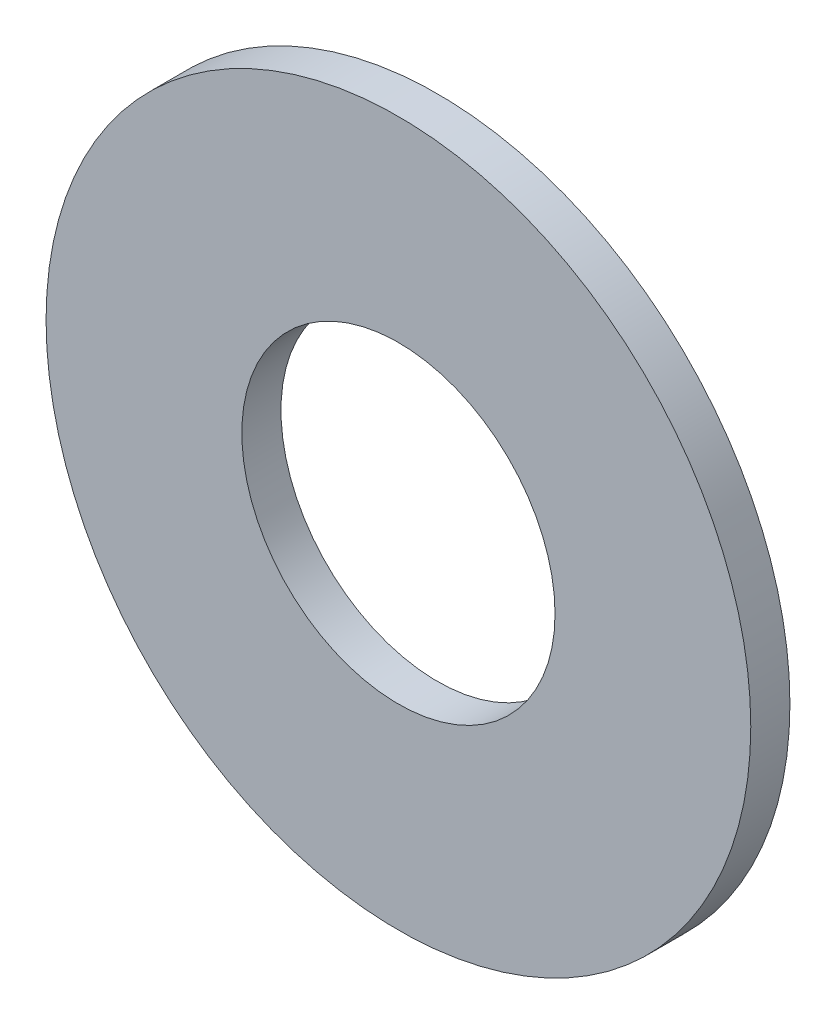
from build123d import *

# Parameters (mm, degrees)
ESQUISSE1_R          = 9
ESQUISSE1_R_2        = 4
BASE_EXTRUSION_DEPTH = 1


with BuildPart() as part:
    # Esquisse1 → Base-Extrusion (new body)
    with BuildSketch(Plane.XY):
        Circle(ESQUISSE1_R)
        Circle(ESQUISSE1_R_2, mode=Mode.SUBTRACT)
    extrude(amount=BASE_EXTRUSION_DEPTH)


solid = part.part
